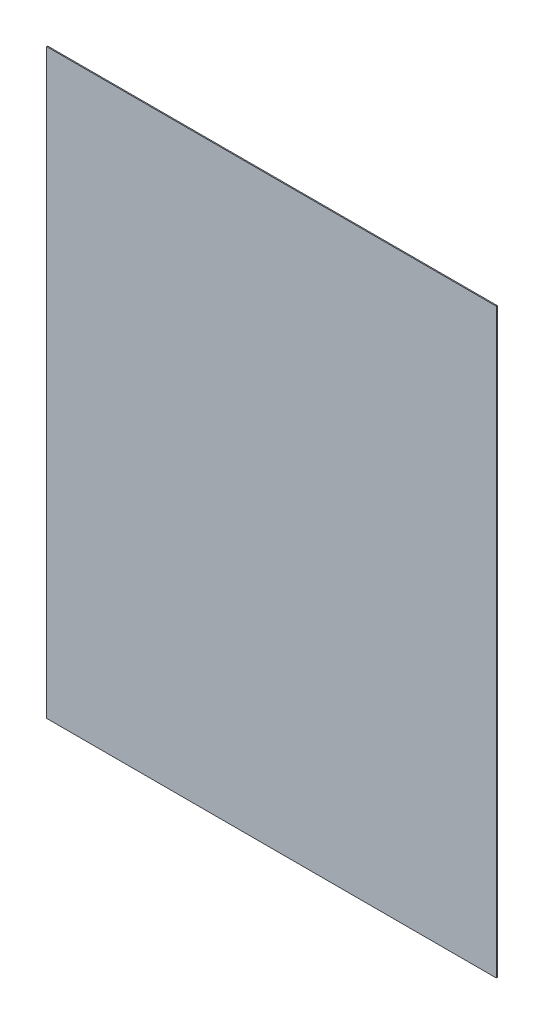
from build123d import *

# Parameters (mm, degrees)
SKETCH1_W           = 215.9
SKETCH1_H           = 279.4
BOSS_EXTRUDE1_DEPTH = 0.5


with BuildPart() as part:
    # Sketch1 → Boss-Extrude1 (new body)
    with BuildSketch(Plane.XY):
        Rectangle(SKETCH1_W, SKETCH1_H)
    extrude(amount=BOSS_EXTRUDE1_DEPTH)


solid = part.part
